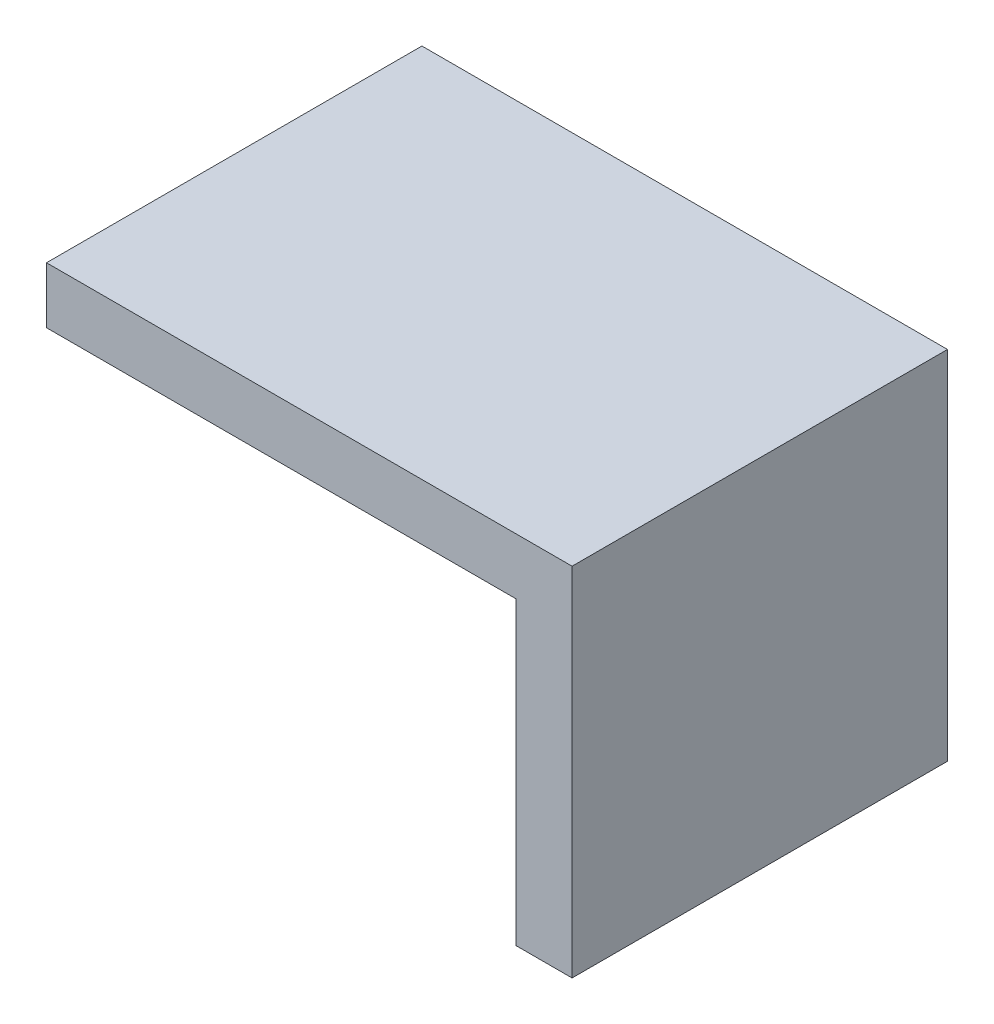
from build123d import *

# Parameters (mm, degrees)
BOSS_EXTRUDE1_DEPTH = 20


with BuildPart() as part:
    # Sketch1 → Boss-Extrude1 (new body)
    with BuildSketch(Plane.XY):
        Polygon((22.611469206, 16), (47.611469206, 16), (47.611469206, 0), (50.611469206, 0), (50.611469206, 19), (22.611469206, 19), align=None)
    extrude(amount=-BOSS_EXTRUDE1_DEPTH)


solid = part.part
